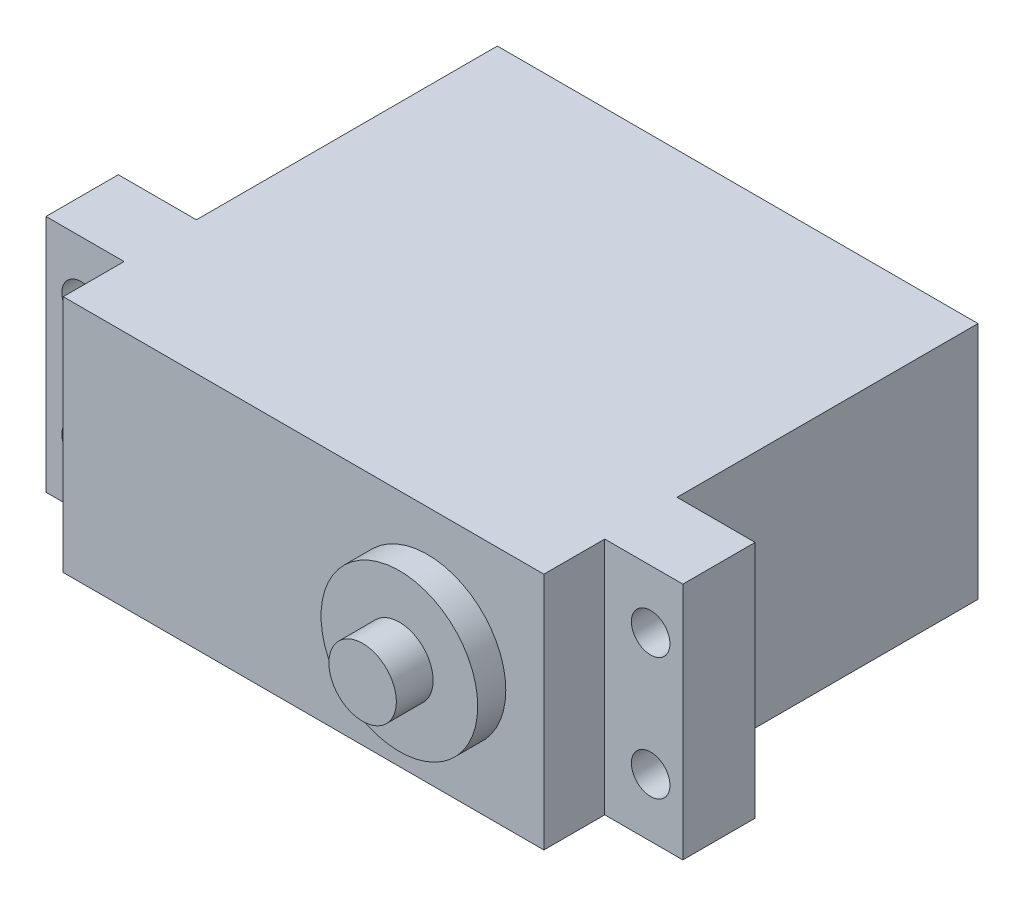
ISO-10303-21;
HEADER;
FILE_DESCRIPTION(('STEP AP214'),'2;1');
FILE_NAME('part.step','',(''),(''),'','','');
FILE_SCHEMA(('AUTOMOTIVE_DESIGN { 1 0 10303 214 1 1 1 1 }'));
ENDSEC;
DATA;
#1=APPLICATION_CONTEXT('core data for automotive mechanical design processes');
#2=APPLICATION_PROTOCOL_DEFINITION('international standard','automotive_design',2000,#1);
#3=PRODUCT_CONTEXT('',#1,'mechanical');
#4=PRODUCT('Part','Part','',(#3));
#5=PRODUCT_RELATED_PRODUCT_CATEGORY('part','',(#4));
#6=PRODUCT_DEFINITION_FORMATION('','',#4);
#7=PRODUCT_DEFINITION_CONTEXT('part definition',#1,'design');
#8=PRODUCT_DEFINITION('design','',#6,#7);
#9=PRODUCT_DEFINITION_SHAPE('','',#8);
#10=(LENGTH_UNIT() NAMED_UNIT(*) SI_UNIT(.MILLI.,.METRE.));
#11=(NAMED_UNIT(*) PLANE_ANGLE_UNIT() SI_UNIT($,.RADIAN.));
#12=(NAMED_UNIT(*) SI_UNIT($,.STERADIAN.) SOLID_ANGLE_UNIT());
#13=UNCERTAINTY_MEASURE_WITH_UNIT(LENGTH_MEASURE(1.E-05),#10,'distance_accuracy_value','');
#14=(GEOMETRIC_REPRESENTATION_CONTEXT(3) GLOBAL_UNCERTAINTY_ASSIGNED_CONTEXT((#13)) GLOBAL_UNIT_ASSIGNED_CONTEXT((#10,
#11,#12)) REPRESENTATION_CONTEXT('',''));
#15=CARTESIAN_POINT('',(0.,0.,0.));
#16=DIRECTION('',(0.,0.,1.));
#17=DIRECTION('',(1.,0.,0.));
#18=AXIS2_PLACEMENT_3D('',#15,#16,#17);
#19=CARTESIAN_POINT('',(-30.22,9.91,36.02));
#20=DIRECTION('',(1.,0.,0.));
#21=DIRECTION('',(0.,1.,0.));
#22=AXIS2_PLACEMENT_3D('',#19,#20,#21);
#23=PLANE('',#22);
#24=DIRECTION('',(0.,-1.,0.));
#25=VECTOR('',#24,1.);
#26=CARTESIAN_POINT('',(-30.22,9.91,24.97));
#27=LINE('',#26,#25);
#28=CARTESIAN_POINT('',(-30.22,9.90999999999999,24.97));
#29=VERTEX_POINT('',#28);
#30=CARTESIAN_POINT('',(-30.22,-9.91000000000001,24.97));
#31=VERTEX_POINT('',#30);
#32=EDGE_CURVE('E186',#29,#31,#27,.T.);
#33=ORIENTED_EDGE('',*,*,#32,.F.);
#34=DIRECTION('',(0.,0.,-1.));
#35=VECTOR('',#34,1.);
#36=CARTESIAN_POINT('',(-30.22,9.91,36.02));
#37=LINE('',#36,#35);
#38=CARTESIAN_POINT('',(-30.22,9.91,0.));
#39=VERTEX_POINT('',#38);
#40=EDGE_CURVE('E211',#29,#39,#37,.T.);
#41=ORIENTED_EDGE('',*,*,#40,.T.);
#42=DIRECTION('',(0.,-1.,0.));
#43=VECTOR('',#42,1.);
#44=CARTESIAN_POINT('',(-30.22,9.91,0.));
#45=LINE('',#44,#43);
#46=CARTESIAN_POINT('',(-30.22,-9.91,0.));
#47=VERTEX_POINT('',#46);
#48=EDGE_CURVE('E198',#39,#47,#45,.T.);
#49=ORIENTED_EDGE('',*,*,#48,.T.);
#50=DIRECTION('',(0.,0.,-1.));
#51=VECTOR('',#50,1.);
#52=CARTESIAN_POINT('',(-30.22,-9.91,36.02));
#53=LINE('',#52,#51);
#54=EDGE_CURVE('E38',#31,#47,#53,.T.);
#55=ORIENTED_EDGE('',*,*,#54,.F.);
#56=EDGE_LOOP('',(#33,#41,#49,#55));
#57=FACE_BOUND('',#56,.T.);
#58=ADVANCED_FACE('F30',(#57),#23,.F.);
#59=CARTESIAN_POINT('',(9.66,9.91,36.02));
#60=DIRECTION('',(-1.,0.,0.));
#61=DIRECTION('',(0.,0.,1.));
#62=AXIS2_PLACEMENT_3D('',#59,#60,#61);
#63=PLANE('',#62);
#64=DIRECTION('',(0.,1.,0.));
#65=VECTOR('',#64,1.);
#66=CARTESIAN_POINT('',(9.66,9.91,24.97));
#67=LINE('',#66,#65);
#68=CARTESIAN_POINT('',(9.66,-9.91000000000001,24.97));
#69=VERTEX_POINT('',#68);
#70=CARTESIAN_POINT('',(9.65999999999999,9.90999999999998,24.97));
#71=VERTEX_POINT('',#70);
#72=EDGE_CURVE('E184',#69,#71,#67,.T.);
#73=ORIENTED_EDGE('',*,*,#72,.F.);
#74=DIRECTION('',(0.,0.,-1.));
#75=VECTOR('',#74,1.);
#76=CARTESIAN_POINT('',(9.66,-9.91,36.02));
#77=LINE('',#76,#75);
#78=CARTESIAN_POINT('',(9.66,-9.91,0.));
#79=VERTEX_POINT('',#78);
#80=EDGE_CURVE('E226',#69,#79,#77,.T.);
#81=ORIENTED_EDGE('',*,*,#80,.T.);
#82=DIRECTION('',(0.,1.,0.));
#83=VECTOR('',#82,1.);
#84=CARTESIAN_POINT('',(9.66,9.91,0.));
#85=LINE('',#84,#83);
#86=CARTESIAN_POINT('',(9.66,9.91,0.));
#87=VERTEX_POINT('',#86);
#88=EDGE_CURVE('E217',#79,#87,#85,.T.);
#89=ORIENTED_EDGE('',*,*,#88,.T.);
#90=DIRECTION('',(0.,0.,-1.));
#91=VECTOR('',#90,1.);
#92=CARTESIAN_POINT('',(9.66,9.91,36.02));
#93=LINE('',#92,#91);
#94=EDGE_CURVE('E224',#71,#87,#93,.T.);
#95=ORIENTED_EDGE('',*,*,#94,.F.);
#96=EDGE_LOOP('',(#73,#81,#89,#95));
#97=FACE_BOUND('',#96,.T.);
#98=ADVANCED_FACE('F235',(#97),#63,.F.);
#99=CARTESIAN_POINT('',(0.,0.,38.35));
#100=DIRECTION('',(0.,0.,1.));
#101=DIRECTION('',(1.,0.,0.));
#102=AXIS2_PLACEMENT_3D('',#99,#100,#101);
#103=PLANE('',#102);
#104=CARTESIAN_POINT('',(0.,0.,38.35));
#105=DIRECTION('',(0.,0.,1.));
#106=DIRECTION('',(1.,0.,0.));
#107=AXIS2_PLACEMENT_3D('',#104,#105,#106);
#108=CIRCLE('',#107,6.5);
#109=CARTESIAN_POINT('',(6.5,0.,38.35));
#110=VERTEX_POINT('',#109);
#111=EDGE_CURVE('E195',#110,#110,#108,.T.);
#112=ORIENTED_EDGE('',*,*,#111,.T.);
#113=EDGE_LOOP('',(#112));
#114=FACE_BOUND('',#113,.T.);
#115=CARTESIAN_POINT('',(0.,0.,38.35));
#116=DIRECTION('',(0.,0.,1.));
#117=DIRECTION('',(1.,0.,0.));
#118=AXIS2_PLACEMENT_3D('',#115,#116,#117);
#119=CIRCLE('',#118,2.8);
#120=CARTESIAN_POINT('',(2.8,0.,38.35));
#121=VERTEX_POINT('',#120);
#122=EDGE_CURVE('E188',#121,#121,#119,.T.);
#123=ORIENTED_EDGE('',*,*,#122,.F.);
#124=EDGE_LOOP('',(#123));
#125=FACE_BOUND('',#124,.T.);
#126=ADVANCED_FACE('F272',(#114,#125),#103,.T.);
#127=CARTESIAN_POINT('',(-30.22,-9.91,36.02));
#128=DIRECTION('',(0.,0.,1.));
#129=DIRECTION('',(1.,0.,0.));
#130=AXIS2_PLACEMENT_3D('',#127,#128,#129);
#131=PLANE('',#130);
#132=DIRECTION('',(0.,-1.,0.));
#133=VECTOR('',#132,1.);
#134=CARTESIAN_POINT('',(-30.22,9.91,36.02));
#135=LINE('',#134,#133);
#136=CARTESIAN_POINT('',(-30.22,9.91,36.02));
#137=VERTEX_POINT('',#136);
#138=CARTESIAN_POINT('',(-30.22,-9.91,36.02));
#139=VERTEX_POINT('',#138);
#140=EDGE_CURVE('E201',#137,#139,#135,.T.);
#141=ORIENTED_EDGE('',*,*,#140,.T.);
#142=DIRECTION('',(1.,0.,0.));
#143=VECTOR('',#142,1.);
#144=CARTESIAN_POINT('',(-30.22,-9.91,36.02));
#145=LINE('',#144,#143);
#146=CARTESIAN_POINT('',(9.66,-9.91,36.02));
#147=VERTEX_POINT('',#146);
#148=EDGE_CURVE('E204',#139,#147,#145,.T.);
#149=ORIENTED_EDGE('',*,*,#148,.T.);
#150=DIRECTION('',(0.,1.,0.));
#151=VECTOR('',#150,1.);
#152=CARTESIAN_POINT('',(9.66,9.91,36.02));
#153=LINE('',#152,#151);
#154=CARTESIAN_POINT('',(9.66,9.91,36.02));
#155=VERTEX_POINT('',#154);
#156=EDGE_CURVE('E207',#147,#155,#153,.T.);
#157=ORIENTED_EDGE('',*,*,#156,.T.);
#158=DIRECTION('',(-1.,0.,0.));
#159=VECTOR('',#158,1.);
#160=CARTESIAN_POINT('',(-30.22,9.91,36.02));
#161=LINE('',#160,#159);
#162=EDGE_CURVE('E209',#155,#137,#161,.T.);
#163=ORIENTED_EDGE('',*,*,#162,.T.);
#164=EDGE_LOOP('',(#141,#149,#157,#163));
#165=FACE_BOUND('',#164,.T.);
#166=CARTESIAN_POINT('',(0.,0.,36.02));
#167=DIRECTION('',(0.,0.,1.));
#168=DIRECTION('',(1.,0.,0.));
#169=AXIS2_PLACEMENT_3D('',#166,#167,#168);
#170=CIRCLE('',#169,6.5);
#171=CARTESIAN_POINT('',(6.5,0.,36.02));
#172=VERTEX_POINT('',#171);
#173=EDGE_CURVE('E192',#172,#172,#170,.T.);
#174=ORIENTED_EDGE('',*,*,#173,.F.);
#175=EDGE_LOOP('',(#174));
#176=FACE_BOUND('',#175,.T.);
#177=ADVANCED_FACE('F263',(#165,#176),#131,.T.);
#178=CARTESIAN_POINT('',(-30.22,9.90999999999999,30.97));
#179=VERTEX_POINT('',#178);
#180=EDGE_CURVE('E222',#137,#179,#37,.T.);
#181=ORIENTED_EDGE('',*,*,#180,.T.);
#182=DIRECTION('',(0.,-1.,0.));
#183=VECTOR('',#182,1.);
#184=CARTESIAN_POINT('',(-30.22,9.91,30.97));
#185=LINE('',#184,#183);
#186=CARTESIAN_POINT('',(-30.22,-9.91,30.97));
#187=VERTEX_POINT('',#186);
#188=EDGE_CURVE('E137',#179,#187,#185,.T.);
#189=ORIENTED_EDGE('',*,*,#188,.T.);
#190=EDGE_CURVE('E11',#139,#187,#53,.T.);
#191=ORIENTED_EDGE('',*,*,#190,.F.);
#192=ORIENTED_EDGE('',*,*,#140,.F.);
#193=EDGE_LOOP('',(#181,#189,#191,#192));
#194=FACE_BOUND('',#193,.T.);
#195=ADVANCED_FACE('F32',(#194),#23,.F.);
#196=CARTESIAN_POINT('',(-30.22,-9.91,36.02));
#197=DIRECTION('',(0.,1.,0.));
#198=DIRECTION('',(-1.,0.,0.));
#199=AXIS2_PLACEMENT_3D('',#196,#197,#198);
#200=PLANE('',#199);
#201=ORIENTED_EDGE('',*,*,#190,.T.);
#202=DIRECTION('',(-1.,0.,0.));
#203=VECTOR('',#202,1.);
#204=CARTESIAN_POINT('',(-36.7,-9.91000000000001,30.97));
#205=LINE('',#204,#203);
#206=CARTESIAN_POINT('',(-36.7,-9.91000000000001,30.97));
#207=VERTEX_POINT('',#206);
#208=EDGE_CURVE('E45',#187,#207,#205,.T.);
#209=ORIENTED_EDGE('',*,*,#208,.T.);
#210=DIRECTION('',(0.,0.,1.));
#211=VECTOR('',#210,1.);
#212=CARTESIAN_POINT('',(-36.7,-9.91000000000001,24.97));
#213=LINE('',#212,#211);
#214=CARTESIAN_POINT('',(-36.7,-9.91000000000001,24.97));
#215=VERTEX_POINT('',#214);
#216=EDGE_CURVE('E143',#215,#207,#213,.T.);
#217=ORIENTED_EDGE('',*,*,#216,.F.);
#218=DIRECTION('',(-1.,0.,0.));
#219=VECTOR('',#218,1.);
#220=CARTESIAN_POINT('',(-36.7,-9.91000000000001,24.97));
#221=LINE('',#220,#219);
#222=EDGE_CURVE('E174',#31,#215,#221,.T.);
#223=ORIENTED_EDGE('',*,*,#222,.F.);
#224=ORIENTED_EDGE('',*,*,#54,.T.);
#225=DIRECTION('',(1.,0.,0.));
#226=VECTOR('',#225,1.);
#227=CARTESIAN_POINT('',(-30.22,-9.91,0.));
#228=LINE('',#227,#226);
#229=EDGE_CURVE('E214',#47,#79,#228,.T.);
#230=ORIENTED_EDGE('',*,*,#229,.T.);
#231=ORIENTED_EDGE('',*,*,#80,.F.);
#232=CARTESIAN_POINT('',(16.14,-9.91000000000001,24.97));
#233=VERTEX_POINT('',#232);
#234=EDGE_CURVE('E175',#233,#69,#221,.T.);
#235=ORIENTED_EDGE('',*,*,#234,.F.);
#236=DIRECTION('',(0.,0.,1.));
#237=VECTOR('',#236,1.);
#238=CARTESIAN_POINT('',(16.14,-9.91000000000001,24.97));
#239=LINE('',#238,#237);
#240=CARTESIAN_POINT('',(16.14,-9.91000000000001,30.97));
#241=VERTEX_POINT('',#240);
#242=EDGE_CURVE('E178',#233,#241,#239,.T.);
#243=ORIENTED_EDGE('',*,*,#242,.T.);
#244=CARTESIAN_POINT('',(9.66,-9.91000000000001,30.97));
#245=VERTEX_POINT('',#244);
#246=EDGE_CURVE('E153',#241,#245,#205,.T.);
#247=ORIENTED_EDGE('',*,*,#246,.T.);
#248=EDGE_CURVE('E227',#147,#245,#77,.T.);
#249=ORIENTED_EDGE('',*,*,#248,.F.);
#250=ORIENTED_EDGE('',*,*,#148,.F.);
#251=EDGE_LOOP('',(#201,#209,#217,#223,#224,#230,#231,#235,#243,#247,#249,#250));
#252=FACE_BOUND('',#251,.T.);
#253=ADVANCED_FACE('F242',(#252),#200,.F.);
#254=ORIENTED_EDGE('',*,*,#248,.T.);
#255=DIRECTION('',(0.,1.,0.));
#256=VECTOR('',#255,1.);
#257=CARTESIAN_POINT('',(9.66,9.91,30.97));
#258=LINE('',#257,#256);
#259=CARTESIAN_POINT('',(9.66,9.91,30.97));
#260=VERTEX_POINT('',#259);
#261=EDGE_CURVE('E132',#245,#260,#258,.T.);
#262=ORIENTED_EDGE('',*,*,#261,.T.);
#263=EDGE_CURVE('E225',#155,#260,#93,.T.);
#264=ORIENTED_EDGE('',*,*,#263,.F.);
#265=ORIENTED_EDGE('',*,*,#156,.F.);
#266=EDGE_LOOP('',(#254,#262,#264,#265));
#267=FACE_BOUND('',#266,.T.);
#268=ADVANCED_FACE('F259',(#267),#63,.F.);
#269=CARTESIAN_POINT('',(-30.22,9.91,36.02));
#270=DIRECTION('',(0.,-1.,0.));
#271=DIRECTION('',(1.,0.,0.));
#272=AXIS2_PLACEMENT_3D('',#269,#270,#271);
#273=PLANE('',#272);
#274=ORIENTED_EDGE('',*,*,#263,.T.);
#275=DIRECTION('',(1.,0.,0.));
#276=VECTOR('',#275,1.);
#277=CARTESIAN_POINT('',(-36.7,9.90999999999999,30.97));
#278=LINE('',#277,#276);
#279=CARTESIAN_POINT('',(16.14,9.90999999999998,30.97));
#280=VERTEX_POINT('',#279);
#281=EDGE_CURVE('E53',#260,#280,#278,.T.);
#282=ORIENTED_EDGE('',*,*,#281,.T.);
#283=DIRECTION('',(0.,0.,1.));
#284=VECTOR('',#283,1.);
#285=CARTESIAN_POINT('',(16.14,9.90999999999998,24.97));
#286=LINE('',#285,#284);
#287=CARTESIAN_POINT('',(16.14,9.90999999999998,24.97));
#288=VERTEX_POINT('',#287);
#289=EDGE_CURVE('E133',#288,#280,#286,.T.);
#290=ORIENTED_EDGE('',*,*,#289,.F.);
#291=DIRECTION('',(1.,0.,0.));
#292=VECTOR('',#291,1.);
#293=CARTESIAN_POINT('',(-36.7,9.90999999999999,24.97));
#294=LINE('',#293,#292);
#295=EDGE_CURVE('E170',#71,#288,#294,.T.);
#296=ORIENTED_EDGE('',*,*,#295,.F.);
#297=ORIENTED_EDGE('',*,*,#94,.T.);
#298=DIRECTION('',(-1.,0.,0.));
#299=VECTOR('',#298,1.);
#300=CARTESIAN_POINT('',(-30.22,9.91,0.));
#301=LINE('',#300,#299);
#302=EDGE_CURVE('E205',#87,#39,#301,.T.);
#303=ORIENTED_EDGE('',*,*,#302,.T.);
#304=ORIENTED_EDGE('',*,*,#40,.F.);
#305=CARTESIAN_POINT('',(-36.7,9.90999999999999,24.97));
#306=VERTEX_POINT('',#305);
#307=EDGE_CURVE('E127',#306,#29,#294,.T.);
#308=ORIENTED_EDGE('',*,*,#307,.F.);
#309=DIRECTION('',(0.,0.,1.));
#310=VECTOR('',#309,1.);
#311=CARTESIAN_POINT('',(-36.7,9.90999999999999,24.97));
#312=LINE('',#311,#310);
#313=CARTESIAN_POINT('',(-36.7,9.90999999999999,30.97));
#314=VERTEX_POINT('',#313);
#315=EDGE_CURVE('E119',#306,#314,#312,.T.);
#316=ORIENTED_EDGE('',*,*,#315,.T.);
#317=EDGE_CURVE('E124',#314,#179,#278,.T.);
#318=ORIENTED_EDGE('',*,*,#317,.T.);
#319=ORIENTED_EDGE('',*,*,#180,.F.);
#320=ORIENTED_EDGE('',*,*,#162,.F.);
#321=EDGE_LOOP('',(#274,#282,#290,#296,#297,#303,#304,#308,#316,#318,#319,#320));
#322=FACE_BOUND('',#321,.T.);
#323=ADVANCED_FACE('F122',(#322),#273,.F.);
#324=CARTESIAN_POINT('',(-30.22,-9.91,0.));
#325=DIRECTION('',(0.,0.,1.));
#326=DIRECTION('',(1.,0.,0.));
#327=AXIS2_PLACEMENT_3D('',#324,#325,#326);
#328=PLANE('',#327);
#329=ORIENTED_EDGE('',*,*,#48,.F.);
#330=ORIENTED_EDGE('',*,*,#302,.F.);
#331=ORIENTED_EDGE('',*,*,#88,.F.);
#332=ORIENTED_EDGE('',*,*,#229,.F.);
#333=EDGE_LOOP('',(#329,#330,#331,#332));
#334=FACE_BOUND('',#333,.T.);
#335=ADVANCED_FACE('F247',(#334),#328,.F.);
#336=CARTESIAN_POINT('',(0.,0.,38.35));
#337=DIRECTION('',(0.,0.,-1.));
#338=DIRECTION('',(-1.,0.,0.));
#339=AXIS2_PLACEMENT_3D('',#336,#337,#338);
#340=CYLINDRICAL_SURFACE('',#339,6.5);
#341=ORIENTED_EDGE('',*,*,#111,.F.);
#342=EDGE_LOOP('',(#341));
#343=FACE_BOUND('',#342,.T.);
#344=ORIENTED_EDGE('',*,*,#173,.T.);
#345=EDGE_LOOP('',(#344));
#346=FACE_BOUND('',#345,.T.);
#347=ADVANCED_FACE('F311',(#343,#346),#340,.T.);
#348=CARTESIAN_POINT('',(0.,0.,41.4));
#349=DIRECTION('',(0.,0.,-1.));
#350=DIRECTION('',(-1.,0.,0.));
#351=AXIS2_PLACEMENT_3D('',#348,#349,#350);
#352=CYLINDRICAL_SURFACE('',#351,2.8);
#353=CARTESIAN_POINT('',(0.,0.,41.4));
#354=DIRECTION('',(0.,0.,1.));
#355=DIRECTION('',(1.,0.,0.));
#356=AXIS2_PLACEMENT_3D('',#353,#354,#355);
#357=CIRCLE('',#356,2.8);
#358=CARTESIAN_POINT('',(2.8,0.,41.4));
#359=VERTEX_POINT('',#358);
#360=EDGE_CURVE('E189',#359,#359,#357,.T.);
#361=ORIENTED_EDGE('',*,*,#360,.F.);
#362=EDGE_LOOP('',(#361));
#363=FACE_BOUND('',#362,.T.);
#364=ORIENTED_EDGE('',*,*,#122,.T.);
#365=EDGE_LOOP('',(#364));
#366=FACE_BOUND('',#365,.T.);
#367=ADVANCED_FACE('F307',(#363,#366),#352,.T.);
#368=CARTESIAN_POINT('',(0.,0.,41.4));
#369=DIRECTION('',(0.,0.,1.));
#370=DIRECTION('',(1.,0.,0.));
#371=AXIS2_PLACEMENT_3D('',#368,#369,#370);
#372=PLANE('',#371);
#373=ORIENTED_EDGE('',*,*,#360,.T.);
#374=EDGE_LOOP('',(#373));
#375=FACE_BOUND('',#374,.T.);
#376=ADVANCED_FACE('F302',(#375),#372,.T.);
#377=CARTESIAN_POINT('',(16.14,9.90999999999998,24.97));
#378=DIRECTION('',(-1.,0.,0.));
#379=DIRECTION('',(0.,-1.,0.));
#380=AXIS2_PLACEMENT_3D('',#377,#378,#379);
#381=PLANE('',#380);
#382=ORIENTED_EDGE('',*,*,#289,.T.);
#383=DIRECTION('',(0.,-1.,0.));
#384=VECTOR('',#383,1.);
#385=CARTESIAN_POINT('',(16.14,9.90999999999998,30.97));
#386=LINE('',#385,#384);
#387=EDGE_CURVE('E138',#280,#241,#386,.T.);
#388=ORIENTED_EDGE('',*,*,#387,.T.);
#389=ORIENTED_EDGE('',*,*,#242,.F.);
#390=DIRECTION('',(0.,-1.,0.));
#391=VECTOR('',#390,1.);
#392=CARTESIAN_POINT('',(16.14,9.90999999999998,24.97));
#393=LINE('',#392,#391);
#394=EDGE_CURVE('E172',#288,#233,#393,.T.);
#395=ORIENTED_EDGE('',*,*,#394,.F.);
#396=EDGE_LOOP('',(#382,#388,#389,#395));
#397=FACE_BOUND('',#396,.T.);
#398=ADVANCED_FACE('F256',(#397),#381,.F.);
#399=CARTESIAN_POINT('',(13.47,-5.085,24.97));
#400=DIRECTION('',(0.,0.,1.));
#401=DIRECTION('',(1.,0.,0.));
#402=AXIS2_PLACEMENT_3D('',#399,#400,#401);
#403=CYLINDRICAL_SURFACE('',#402,1.6);
#404=CARTESIAN_POINT('',(13.47,-5.085,24.97));
#405=DIRECTION('',(0.,0.,-1.));
#406=DIRECTION('',(-1.,0.,0.));
#407=AXIS2_PLACEMENT_3D('',#404,#405,#406);
#408=CIRCLE('',#407,1.6);
#409=CARTESIAN_POINT('',(11.87,-5.085,24.97));
#410=VERTEX_POINT('',#409);
#411=EDGE_CURVE('E156',#410,#410,#408,.T.);
#412=ORIENTED_EDGE('',*,*,#411,.T.);
#413=EDGE_LOOP('',(#412));
#414=FACE_BOUND('',#413,.T.);
#415=CARTESIAN_POINT('',(13.47,-5.085,30.97));
#416=DIRECTION('',(0.,0.,-1.));
#417=DIRECTION('',(-1.,0.,0.));
#418=AXIS2_PLACEMENT_3D('',#415,#416,#417);
#419=CIRCLE('',#418,1.6);
#420=CARTESIAN_POINT('',(11.87,-5.085,30.97));
#421=VERTEX_POINT('',#420);
#422=EDGE_CURVE('E424',#421,#421,#419,.T.);
#423=ORIENTED_EDGE('',*,*,#422,.F.);
#424=EDGE_LOOP('',(#423));
#425=FACE_BOUND('',#424,.T.);
#426=ADVANCED_FACE('F301',(#414,#425),#403,.F.);
#427=CARTESIAN_POINT('',(13.47,5.085,24.97));
#428=DIRECTION('',(0.,0.,1.));
#429=DIRECTION('',(1.,0.,0.));
#430=AXIS2_PLACEMENT_3D('',#427,#428,#429);
#431=CYLINDRICAL_SURFACE('',#430,1.6);
#432=CARTESIAN_POINT('',(13.47,5.085,24.97));
#433=DIRECTION('',(0.,0.,-1.));
#434=DIRECTION('',(-1.,0.,0.));
#435=AXIS2_PLACEMENT_3D('',#432,#433,#434);
#436=CIRCLE('',#435,1.6);
#437=CARTESIAN_POINT('',(11.87,5.085,24.97));
#438=VERTEX_POINT('',#437);
#439=EDGE_CURVE('E159',#438,#438,#436,.T.);
#440=ORIENTED_EDGE('',*,*,#439,.T.);
#441=EDGE_LOOP('',(#440));
#442=FACE_BOUND('',#441,.T.);
#443=CARTESIAN_POINT('',(13.47,5.085,30.97));
#444=DIRECTION('',(0.,0.,-1.));
#445=DIRECTION('',(-1.,0.,0.));
#446=AXIS2_PLACEMENT_3D('',#443,#444,#445);
#447=CIRCLE('',#446,1.6);
#448=CARTESIAN_POINT('',(11.87,5.085,30.97));
#449=VERTEX_POINT('',#448);
#450=EDGE_CURVE('E422',#449,#449,#447,.T.);
#451=ORIENTED_EDGE('',*,*,#450,.F.);
#452=EDGE_LOOP('',(#451));
#453=FACE_BOUND('',#452,.T.);
#454=ADVANCED_FACE('F359',(#442,#453),#431,.F.);
#455=CARTESIAN_POINT('',(-36.7,-9.91000000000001,30.97));
#456=DIRECTION('',(0.,0.,1.));
#457=DIRECTION('',(1.,0.,0.));
#458=AXIS2_PLACEMENT_3D('',#455,#456,#457);
#459=PLANE('',#458);
#460=ORIENTED_EDGE('',*,*,#450,.T.);
#461=EDGE_LOOP('',(#460));
#462=FACE_BOUND('',#461,.T.);
#463=ORIENTED_EDGE('',*,*,#422,.T.);
#464=EDGE_LOOP('',(#463));
#465=FACE_BOUND('',#464,.T.);
#466=ORIENTED_EDGE('',*,*,#261,.F.);
#467=ORIENTED_EDGE('',*,*,#246,.F.);
#468=ORIENTED_EDGE('',*,*,#387,.F.);
#469=ORIENTED_EDGE('',*,*,#281,.F.);
#470=EDGE_LOOP('',(#466,#467,#468,#469));
#471=FACE_BOUND('',#470,.T.);
#472=ADVANCED_FACE('F257',(#462,#465,#471),#459,.T.);
#473=CARTESIAN_POINT('',(-36.7,-9.91000000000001,24.97));
#474=DIRECTION('',(0.,0.,1.));
#475=DIRECTION('',(1.,0.,0.));
#476=AXIS2_PLACEMENT_3D('',#473,#474,#475);
#477=PLANE('',#476);
#478=ORIENTED_EDGE('',*,*,#411,.F.);
#479=EDGE_LOOP('',(#478));
#480=FACE_BOUND('',#479,.T.);
#481=ORIENTED_EDGE('',*,*,#439,.F.);
#482=EDGE_LOOP('',(#481));
#483=FACE_BOUND('',#482,.T.);
#484=ORIENTED_EDGE('',*,*,#234,.T.);
#485=ORIENTED_EDGE('',*,*,#72,.T.);
#486=ORIENTED_EDGE('',*,*,#295,.T.);
#487=ORIENTED_EDGE('',*,*,#394,.T.);
#488=EDGE_LOOP('',(#484,#485,#486,#487));
#489=FACE_BOUND('',#488,.T.);
#490=ADVANCED_FACE('F252',(#480,#483,#489),#477,.F.);
#491=CARTESIAN_POINT('',(-33.79,-5.085,24.97));
#492=DIRECTION('',(0.,0.,-1.));
#493=DIRECTION('',(-1.,0.,0.));
#494=AXIS2_PLACEMENT_3D('',#491,#492,#493);
#495=CIRCLE('',#494,1.6);
#496=CARTESIAN_POINT('',(-35.39,-5.085,24.97));
#497=VERTEX_POINT('',#496);
#498=EDGE_CURVE('E162',#497,#497,#495,.T.);
#499=ORIENTED_EDGE('',*,*,#498,.F.);
#500=EDGE_LOOP('',(#499));
#501=FACE_BOUND('',#500,.T.);
#502=CARTESIAN_POINT('',(-33.79,5.085,24.97));
#503=DIRECTION('',(0.,0.,-1.));
#504=DIRECTION('',(-1.,0.,0.));
#505=AXIS2_PLACEMENT_3D('',#502,#503,#504);
#506=CIRCLE('',#505,1.60000000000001);
#507=CARTESIAN_POINT('',(-35.39,5.085,24.97));
#508=VERTEX_POINT('',#507);
#509=EDGE_CURVE('E165',#508,#508,#506,.T.);
#510=ORIENTED_EDGE('',*,*,#509,.F.);
#511=EDGE_LOOP('',(#510));
#512=FACE_BOUND('',#511,.T.);
#513=ORIENTED_EDGE('',*,*,#307,.T.);
#514=ORIENTED_EDGE('',*,*,#32,.T.);
#515=ORIENTED_EDGE('',*,*,#222,.T.);
#516=DIRECTION('',(0.,1.,0.));
#517=VECTOR('',#516,1.);
#518=CARTESIAN_POINT('',(-36.7,9.90999999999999,24.97));
#519=LINE('',#518,#517);
#520=EDGE_CURVE('E168',#215,#306,#519,.T.);
#521=ORIENTED_EDGE('',*,*,#520,.T.);
#522=EDGE_LOOP('',(#513,#514,#515,#521));
#523=FACE_BOUND('',#522,.T.);
#524=ADVANCED_FACE('F282',(#501,#512,#523),#477,.F.);
#525=CARTESIAN_POINT('',(-33.79,5.085,30.97));
#526=DIRECTION('',(0.,0.,-1.));
#527=DIRECTION('',(-1.,0.,0.));
#528=AXIS2_PLACEMENT_3D('',#525,#526,#527);
#529=CIRCLE('',#528,1.60000000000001);
#530=CARTESIAN_POINT('',(-35.39,5.085,30.97));
#531=VERTEX_POINT('',#530);
#532=EDGE_CURVE('E144',#531,#531,#529,.T.);
#533=ORIENTED_EDGE('',*,*,#532,.T.);
#534=EDGE_LOOP('',(#533));
#535=FACE_BOUND('',#534,.T.);
#536=CARTESIAN_POINT('',(-33.79,-5.085,30.97));
#537=DIRECTION('',(0.,0.,-1.));
#538=DIRECTION('',(-1.,0.,0.));
#539=AXIS2_PLACEMENT_3D('',#536,#537,#538);
#540=CIRCLE('',#539,1.6);
#541=CARTESIAN_POINT('',(-35.39,-5.085,30.97));
#542=VERTEX_POINT('',#541);
#543=EDGE_CURVE('E147',#542,#542,#540,.T.);
#544=ORIENTED_EDGE('',*,*,#543,.T.);
#545=EDGE_LOOP('',(#544));
#546=FACE_BOUND('',#545,.T.);
#547=ORIENTED_EDGE('',*,*,#188,.F.);
#548=ORIENTED_EDGE('',*,*,#317,.F.);
#549=DIRECTION('',(0.,1.,0.));
#550=VECTOR('',#549,1.);
#551=CARTESIAN_POINT('',(-36.7,9.90999999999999,30.97));
#552=LINE('',#551,#550);
#553=EDGE_CURVE('E136',#207,#314,#552,.T.);
#554=ORIENTED_EDGE('',*,*,#553,.F.);
#555=ORIENTED_EDGE('',*,*,#208,.F.);
#556=EDGE_LOOP('',(#547,#548,#554,#555));
#557=FACE_BOUND('',#556,.T.);
#558=ADVANCED_FACE('F135',(#535,#546,#557),#459,.T.);
#559=CARTESIAN_POINT('',(-36.7,9.90999999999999,24.97));
#560=DIRECTION('',(1.,0.,0.));
#561=DIRECTION('',(0.,0.,-1.));
#562=AXIS2_PLACEMENT_3D('',#559,#560,#561);
#563=PLANE('',#562);
#564=ORIENTED_EDGE('',*,*,#216,.T.);
#565=ORIENTED_EDGE('',*,*,#553,.T.);
#566=ORIENTED_EDGE('',*,*,#315,.F.);
#567=ORIENTED_EDGE('',*,*,#520,.F.);
#568=EDGE_LOOP('',(#564,#565,#566,#567));
#569=FACE_BOUND('',#568,.T.);
#570=ADVANCED_FACE('F141',(#569),#563,.F.);
#571=CARTESIAN_POINT('',(-33.79,5.085,24.97));
#572=DIRECTION('',(0.,0.,1.));
#573=DIRECTION('',(1.,0.,0.));
#574=AXIS2_PLACEMENT_3D('',#571,#572,#573);
#575=CYLINDRICAL_SURFACE('',#574,1.60000000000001);
#576=ORIENTED_EDGE('',*,*,#509,.T.);
#577=EDGE_LOOP('',(#576));
#578=FACE_BOUND('',#577,.T.);
#579=ORIENTED_EDGE('',*,*,#532,.F.);
#580=EDGE_LOOP('',(#579));
#581=FACE_BOUND('',#580,.T.);
#582=ADVANCED_FACE('F297',(#578,#581),#575,.F.);
#583=CARTESIAN_POINT('',(-33.79,-5.085,24.97));
#584=DIRECTION('',(0.,0.,1.));
#585=DIRECTION('',(1.,0.,0.));
#586=AXIS2_PLACEMENT_3D('',#583,#584,#585);
#587=CYLINDRICAL_SURFACE('',#586,1.6);
#588=ORIENTED_EDGE('',*,*,#498,.T.);
#589=EDGE_LOOP('',(#588));
#590=FACE_BOUND('',#589,.T.);
#591=ORIENTED_EDGE('',*,*,#543,.F.);
#592=EDGE_LOOP('',(#591));
#593=FACE_BOUND('',#592,.T.);
#594=ADVANCED_FACE('F406',(#590,#593),#587,.F.);
#595=CLOSED_SHELL('',(#58,#98,#126,#177,#195,#253,#268,#323,#335,#347,#367,#376,#398,#426,#454,
#472,#490,#524,#558,#570,#582,#594));
#596=MANIFOLD_SOLID_BREP('B2',#595);
#597=ADVANCED_BREP_SHAPE_REPRESENTATION('',(#18,#596),#14);
#598=SHAPE_DEFINITION_REPRESENTATION(#9,#597);
ENDSEC;
END-ISO-10303-21;
